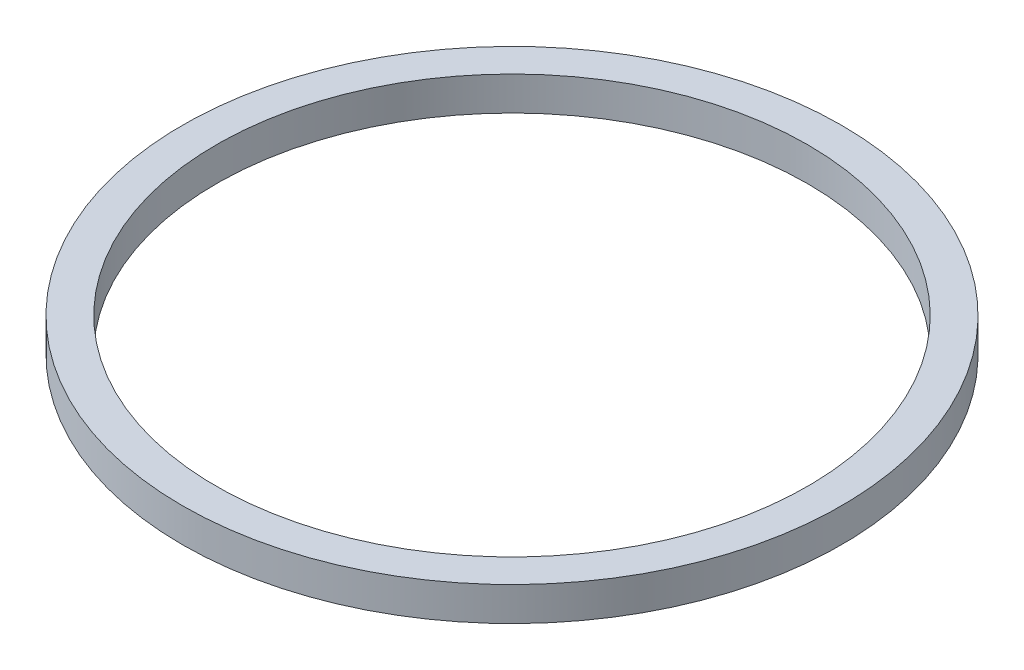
ISO-10303-21;
HEADER;
FILE_DESCRIPTION(('STEP AP214'),'2;1');
FILE_NAME('part.step','',(''),(''),'','','');
FILE_SCHEMA(('AUTOMOTIVE_DESIGN { 1 0 10303 214 1 1 1 1 }'));
ENDSEC;
DATA;
#1=APPLICATION_CONTEXT('core data for automotive mechanical design processes');
#2=APPLICATION_PROTOCOL_DEFINITION('international standard','automotive_design',2000,#1);
#3=PRODUCT_CONTEXT('',#1,'mechanical');
#4=PRODUCT('Part','Part','',(#3));
#5=PRODUCT_RELATED_PRODUCT_CATEGORY('part','',(#4));
#6=PRODUCT_DEFINITION_FORMATION('','',#4);
#7=PRODUCT_DEFINITION_CONTEXT('part definition',#1,'design');
#8=PRODUCT_DEFINITION('design','',#6,#7);
#9=PRODUCT_DEFINITION_SHAPE('','',#8);
#10=(LENGTH_UNIT() NAMED_UNIT(*) SI_UNIT(.MILLI.,.METRE.));
#11=(NAMED_UNIT(*) PLANE_ANGLE_UNIT() SI_UNIT($,.RADIAN.));
#12=(NAMED_UNIT(*) SI_UNIT($,.STERADIAN.) SOLID_ANGLE_UNIT());
#13=UNCERTAINTY_MEASURE_WITH_UNIT(LENGTH_MEASURE(1.E-05),#10,'distance_accuracy_value','');
#14=(GEOMETRIC_REPRESENTATION_CONTEXT(3) GLOBAL_UNCERTAINTY_ASSIGNED_CONTEXT((#13)) GLOBAL_UNIT_ASSIGNED_CONTEXT((#10,
#11,#12)) REPRESENTATION_CONTEXT('',''));
#15=CARTESIAN_POINT('',(0.,0.,0.));
#16=DIRECTION('',(0.,0.,1.));
#17=DIRECTION('',(1.,0.,0.));
#18=AXIS2_PLACEMENT_3D('',#15,#16,#17);
#19=CARTESIAN_POINT('',(0.,0.,0.));
#20=DIRECTION('',(0.,-1.,0.));
#21=DIRECTION('',(0.,0.,-1.));
#22=AXIS2_PLACEMENT_3D('',#19,#20,#21);
#23=CYLINDRICAL_SURFACE('',#22,70.);
#24=CARTESIAN_POINT('',(0.,0.,0.));
#25=DIRECTION('',(0.,-1.,0.));
#26=DIRECTION('',(0.,0.,-1.));
#27=AXIS2_PLACEMENT_3D('',#24,#25,#26);
#28=CIRCLE('',#27,70.);
#29=CARTESIAN_POINT('',(0.,0.,-70.));
#30=VERTEX_POINT('',#29);
#31=EDGE_CURVE('E10',#30,#30,#28,.T.);
#32=ORIENTED_EDGE('',*,*,#31,.T.);
#33=EDGE_LOOP('',(#32));
#34=FACE_BOUND('',#33,.T.);
#35=CARTESIAN_POINT('',(0.,8.,0.));
#36=DIRECTION('',(0.,-1.,0.));
#37=DIRECTION('',(0.,0.,-1.));
#38=AXIS2_PLACEMENT_3D('',#35,#36,#37);
#39=CIRCLE('',#38,70.);
#40=CARTESIAN_POINT('',(0.,8.,-70.));
#41=VERTEX_POINT('',#40);
#42=EDGE_CURVE('E42',#41,#41,#39,.T.);
#43=ORIENTED_EDGE('',*,*,#42,.F.);
#44=EDGE_LOOP('',(#43));
#45=FACE_BOUND('',#44,.T.);
#46=ADVANCED_FACE('F28',(#34,#45),#23,.F.);
#47=CARTESIAN_POINT('',(70.,0.,0.));
#48=DIRECTION('',(0.,-1.,0.));
#49=DIRECTION('',(0.,0.,-1.));
#50=AXIS2_PLACEMENT_3D('',#47,#48,#49);
#51=PLANE('',#50);
#52=CARTESIAN_POINT('',(0.,0.,0.));
#53=DIRECTION('',(0.,-1.,0.));
#54=DIRECTION('',(0.,0.,-1.));
#55=AXIS2_PLACEMENT_3D('',#52,#53,#54);
#56=CIRCLE('',#55,78.);
#57=CARTESIAN_POINT('',(0.,0.,-78.));
#58=VERTEX_POINT('',#57);
#59=EDGE_CURVE('E34',#58,#58,#56,.T.);
#60=ORIENTED_EDGE('',*,*,#59,.T.);
#61=EDGE_LOOP('',(#60));
#62=FACE_BOUND('',#61,.T.);
#63=ORIENTED_EDGE('',*,*,#31,.F.);
#64=EDGE_LOOP('',(#63));
#65=FACE_BOUND('',#64,.T.);
#66=ADVANCED_FACE('F52',(#62,#65),#51,.T.);
#67=CARTESIAN_POINT('',(0.,0.,0.));
#68=DIRECTION('',(0.,-1.,0.));
#69=DIRECTION('',(0.,0.,-1.));
#70=AXIS2_PLACEMENT_3D('',#67,#68,#69);
#71=CYLINDRICAL_SURFACE('',#70,78.);
#72=CARTESIAN_POINT('',(0.,8.,0.));
#73=DIRECTION('',(0.,-1.,0.));
#74=DIRECTION('',(0.,0.,-1.));
#75=AXIS2_PLACEMENT_3D('',#72,#73,#74);
#76=CIRCLE('',#75,78.);
#77=CARTESIAN_POINT('',(0.,8.,-78.));
#78=VERTEX_POINT('',#77);
#79=EDGE_CURVE('E38',#78,#78,#76,.T.);
#80=ORIENTED_EDGE('',*,*,#79,.T.);
#81=EDGE_LOOP('',(#80));
#82=FACE_BOUND('',#81,.T.);
#83=ORIENTED_EDGE('',*,*,#59,.F.);
#84=EDGE_LOOP('',(#83));
#85=FACE_BOUND('',#84,.T.);
#86=ADVANCED_FACE('F56',(#82,#85),#71,.T.);
#87=CARTESIAN_POINT('',(70.,8.,0.));
#88=DIRECTION('',(0.,1.,0.));
#89=DIRECTION('',(0.,0.,1.));
#90=AXIS2_PLACEMENT_3D('',#87,#88,#89);
#91=PLANE('',#90);
#92=ORIENTED_EDGE('',*,*,#42,.T.);
#93=EDGE_LOOP('',(#92));
#94=FACE_BOUND('',#93,.T.);
#95=ORIENTED_EDGE('',*,*,#79,.F.);
#96=EDGE_LOOP('',(#95));
#97=FACE_BOUND('',#96,.T.);
#98=ADVANCED_FACE('F48',(#94,#97),#91,.T.);
#99=CLOSED_SHELL('',(#46,#66,#86,#98));
#100=MANIFOLD_SOLID_BREP('B2',#99);
#101=ADVANCED_BREP_SHAPE_REPRESENTATION('',(#18,#100),#14);
#102=SHAPE_DEFINITION_REPRESENTATION(#9,#101);
ENDSEC;
END-ISO-10303-21;
